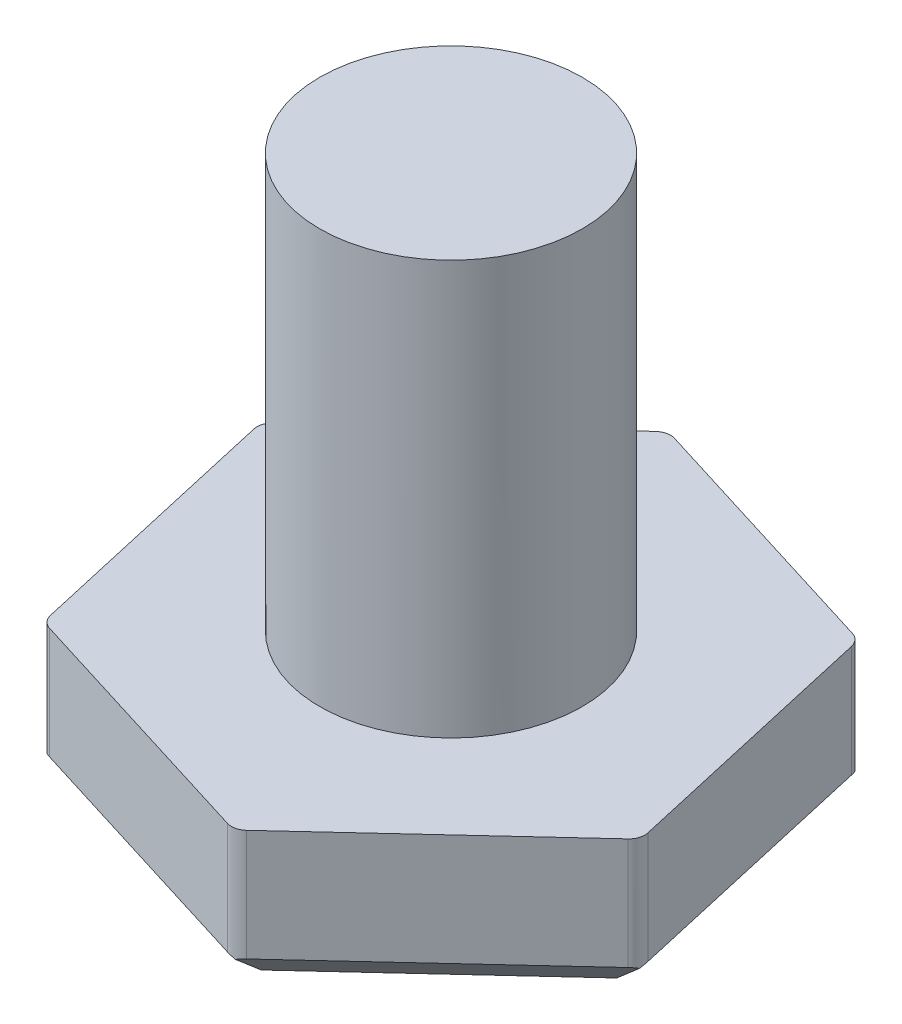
ISO-10303-21;
HEADER;
FILE_DESCRIPTION(('STEP AP214'),'2;1');
FILE_NAME('part.step','',(''),(''),'','','');
FILE_SCHEMA(('AUTOMOTIVE_DESIGN { 1 0 10303 214 1 1 1 1 }'));
ENDSEC;
DATA;
#1=APPLICATION_CONTEXT('core data for automotive mechanical design processes');
#2=APPLICATION_PROTOCOL_DEFINITION('international standard','automotive_design',2000,#1);
#3=PRODUCT_CONTEXT('',#1,'mechanical');
#4=PRODUCT('Part','Part','',(#3));
#5=PRODUCT_RELATED_PRODUCT_CATEGORY('part','',(#4));
#6=PRODUCT_DEFINITION_FORMATION('','',#4);
#7=PRODUCT_DEFINITION_CONTEXT('part definition',#1,'design');
#8=PRODUCT_DEFINITION('design','',#6,#7);
#9=PRODUCT_DEFINITION_SHAPE('','',#8);
#10=(LENGTH_UNIT() NAMED_UNIT(*) SI_UNIT(.MILLI.,.METRE.));
#11=(NAMED_UNIT(*) PLANE_ANGLE_UNIT() SI_UNIT($,.RADIAN.));
#12=(NAMED_UNIT(*) SI_UNIT($,.STERADIAN.) SOLID_ANGLE_UNIT());
#13=UNCERTAINTY_MEASURE_WITH_UNIT(LENGTH_MEASURE(1.E-05),#10,'distance_accuracy_value','');
#14=(GEOMETRIC_REPRESENTATION_CONTEXT(3) GLOBAL_UNCERTAINTY_ASSIGNED_CONTEXT((#13)) GLOBAL_UNIT_ASSIGNED_CONTEXT((#10,
#11,#12)) REPRESENTATION_CONTEXT('',''));
#15=CARTESIAN_POINT('',(0.,0.,0.));
#16=DIRECTION('',(0.,0.,1.));
#17=DIRECTION('',(1.,0.,0.));
#18=AXIS2_PLACEMENT_3D('',#15,#16,#17);
#19=CARTESIAN_POINT('',(0.,6.604,0.));
#20=DIRECTION('',(0.,-1.,0.));
#21=DIRECTION('',(0.,0.,-1.));
#22=AXIS2_PLACEMENT_3D('',#19,#20,#21);
#23=CYLINDRICAL_SURFACE('',#22,2.09536766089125);
#24=CARTESIAN_POINT('',(0.,6.604,0.));
#25=DIRECTION('',(0.,1.,0.));
#26=DIRECTION('',(0.,0.,1.));
#27=AXIS2_PLACEMENT_3D('',#24,#25,#26);
#28=CIRCLE('',#27,2.09536766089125);
#29=CARTESIAN_POINT('',(0.,6.604,2.09536766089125));
#30=VERTEX_POINT('',#29);
#31=EDGE_CURVE('E180',#30,#30,#28,.T.);
#32=ORIENTED_EDGE('',*,*,#31,.F.);
#33=EDGE_LOOP('',(#32));
#34=FACE_BOUND('',#33,.T.);
#35=CARTESIAN_POINT('',(0.,0.,0.));
#36=DIRECTION('',(0.,-1.,0.));
#37=DIRECTION('',(0.,0.,-1.));
#38=AXIS2_PLACEMENT_3D('',#35,#36,#37);
#39=CIRCLE('',#38,2.09536766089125);
#40=CARTESIAN_POINT('',(0.,0.,-2.09536766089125));
#41=VERTEX_POINT('',#40);
#42=EDGE_CURVE('E183',#41,#41,#39,.T.);
#43=ORIENTED_EDGE('',*,*,#42,.F.);
#44=EDGE_LOOP('',(#43));
#45=FACE_BOUND('',#44,.T.);
#46=ADVANCED_FACE('F30',(#34,#45),#23,.T.);
#47=CARTESIAN_POINT('',(0.,6.604,0.));
#48=DIRECTION('',(0.,1.,0.));
#49=DIRECTION('',(0.,0.,1.));
#50=AXIS2_PLACEMENT_3D('',#47,#48,#49);
#51=PLANE('',#50);
#52=ORIENTED_EDGE('',*,*,#31,.T.);
#53=EDGE_LOOP('',(#52));
#54=FACE_BOUND('',#53,.T.);
#55=ADVANCED_FACE('F309',(#54),#51,.T.);
#56=CARTESIAN_POINT('',(3.37823049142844,0.,-3.12501760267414));
#57=DIRECTION('',(0.,-1.,0.));
#58=DIRECTION('',(0.,0.,-1.));
#59=AXIS2_PLACEMENT_3D('',#56,#57,#58);
#60=PLANE('',#59);
#61=DIRECTION('',(-0.221041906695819,0.,-0.975264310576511));
#62=VECTOR('',#61,1.);
#63=CARTESIAN_POINT('',(-3.37823049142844,0.,3.12501760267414));
#64=LINE('',#63,#62);
#65=CARTESIAN_POINT('',(-3.41064561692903,0.,2.98199804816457));
#66=VERTEX_POINT('',#65);
#67=CARTESIAN_POINT('',(-4.36304475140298,0.,-1.22010506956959));
#68=VERTEX_POINT('',#67);
#69=EDGE_CURVE('E296',#66,#68,#64,.T.);
#70=ORIENTED_EDGE('',*,*,#69,.F.);
#71=CARTESIAN_POINT('',(-3.1629284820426,0.,2.92585340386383));
#72=DIRECTION('',(0.,-1.,0.));
#73=DIRECTION('',(0.,0.,-1.));
#74=AXIS2_PLACEMENT_3D('',#71,#72,#73);
#75=CIRCLE('',#74,0.254);
#76=CARTESIAN_POINT('',(-3.23816436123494,0.,3.16845505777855));
#77=VERTEX_POINT('',#76);
#78=EDGE_CURVE('E235',#66,#77,#75,.F.);
#79=ORIENTED_EDGE('',*,*,#78,.T.);
#80=DIRECTION('',(-0.955124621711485,0.,-0.296204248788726));
#81=VECTOR('',#80,1.);
#82=CARTESIAN_POINT('',(1.01722938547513,0.,4.48814222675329));
#83=LINE('',#82,#81);
#84=CARTESIAN_POINT('',(0.877163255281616,0.,4.44470477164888));
#85=VERTEX_POINT('',#84);
#86=EDGE_CURVE('E292',#85,#77,#83,.T.);
#87=ORIENTED_EDGE('',*,*,#86,.F.);
#88=CARTESIAN_POINT('',(0.952399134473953,0.,4.20210311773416));
#89=DIRECTION('',(0.,-1.,0.));
#90=DIRECTION('',(0.,0.,-1.));
#91=AXIS2_PLACEMENT_3D('',#88,#89,#90);
#92=CIRCLE('',#91,0.254);
#93=CARTESIAN_POINT('',(1.12488039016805,0.,4.38856012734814));
#94=VERTEX_POINT('',#93);
#95=EDGE_CURVE('E225',#85,#94,#92,.F.);
#96=ORIENTED_EDGE('',*,*,#95,.T.);
#97=DIRECTION('',(-0.734082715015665,0.,0.679060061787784));
#98=VECTOR('',#97,1.);
#99=CARTESIAN_POINT('',(4.39545987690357,0.,1.36312462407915));
#100=LINE('',#99,#98);
#101=CARTESIAN_POINT('',(4.28780887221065,0.,1.46270672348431));
#102=VERTEX_POINT('',#101);
#103=EDGE_CURVE('E283',#102,#94,#100,.T.);
#104=ORIENTED_EDGE('',*,*,#103,.F.);
#105=CARTESIAN_POINT('',(4.11532761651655,0.,1.27624971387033));
#106=DIRECTION('',(0.,-1.,0.));
#107=DIRECTION('',(0.,0.,-1.));
#108=AXIS2_PLACEMENT_3D('',#105,#106,#107);
#109=CIRCLE('',#108,0.254);
#110=CARTESIAN_POINT('',(4.36304475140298,0.,1.22010506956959));
#111=VERTEX_POINT('',#110);
#112=EDGE_CURVE('E227',#102,#111,#109,.F.);
#113=ORIENTED_EDGE('',*,*,#112,.T.);
#114=DIRECTION('',(0.221041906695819,0.,0.975264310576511));
#115=VECTOR('',#114,1.);
#116=CARTESIAN_POINT('',(3.37823049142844,0.,-3.12501760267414));
#117=LINE('',#116,#115);
#118=CARTESIAN_POINT('',(3.41064561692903,0.,-2.98199804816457));
#119=VERTEX_POINT('',#118);
#120=EDGE_CURVE('E293',#119,#111,#117,.T.);
#121=ORIENTED_EDGE('',*,*,#120,.F.);
#122=CARTESIAN_POINT('',(3.1629284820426,0.,-2.92585340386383));
#123=DIRECTION('',(0.,-1.,0.));
#124=DIRECTION('',(0.,0.,-1.));
#125=AXIS2_PLACEMENT_3D('',#122,#123,#124);
#126=CIRCLE('',#125,0.254);
#127=CARTESIAN_POINT('',(3.23816436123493,0.,-3.16845505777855));
#128=VERTEX_POINT('',#127);
#129=EDGE_CURVE('E229',#119,#128,#126,.F.);
#130=ORIENTED_EDGE('',*,*,#129,.T.);
#131=DIRECTION('',(0.955124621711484,0.,0.296204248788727));
#132=VECTOR('',#131,1.);
#133=CARTESIAN_POINT('',(-1.01722938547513,0.,-4.48814222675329));
#134=LINE('',#133,#132);
#135=CARTESIAN_POINT('',(-0.877163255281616,0.,-4.44470477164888));
#136=VERTEX_POINT('',#135);
#137=EDGE_CURVE('E220',#136,#128,#134,.T.);
#138=ORIENTED_EDGE('',*,*,#137,.F.);
#139=CARTESIAN_POINT('',(-0.952399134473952,0.,-4.20210311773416));
#140=DIRECTION('',(0.,-1.,0.));
#141=DIRECTION('',(0.,0.,-1.));
#142=AXIS2_PLACEMENT_3D('',#139,#140,#141);
#143=CIRCLE('',#142,0.254);
#144=CARTESIAN_POINT('',(-1.12488039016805,0.,-4.38856012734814));
#145=VERTEX_POINT('',#144);
#146=EDGE_CURVE('E231',#136,#145,#143,.F.);
#147=ORIENTED_EDGE('',*,*,#146,.T.);
#148=DIRECTION('',(0.734082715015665,0.,-0.679060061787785));
#149=VECTOR('',#148,1.);
#150=CARTESIAN_POINT('',(-4.39545987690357,0.,-1.36312462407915));
#151=LINE('',#150,#149);
#152=CARTESIAN_POINT('',(-4.28780887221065,0.,-1.4627067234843));
#153=VERTEX_POINT('',#152);
#154=EDGE_CURVE('E303',#153,#145,#151,.T.);
#155=ORIENTED_EDGE('',*,*,#154,.F.);
#156=CARTESIAN_POINT('',(-4.11532761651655,0.,-1.27624971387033));
#157=DIRECTION('',(0.,-1.,0.));
#158=DIRECTION('',(0.,0.,-1.));
#159=AXIS2_PLACEMENT_3D('',#156,#157,#158);
#160=CIRCLE('',#159,0.254);
#161=EDGE_CURVE('E233',#153,#68,#160,.F.);
#162=ORIENTED_EDGE('',*,*,#161,.T.);
#163=EDGE_LOOP('',(#70,#79,#87,#96,#104,#113,#121,#130,#138,#147,#155,#162));
#164=FACE_BOUND('',#163,.T.);
#165=ORIENTED_EDGE('',*,*,#42,.T.);
#166=EDGE_LOOP('',(#165));
#167=FACE_BOUND('',#166,.T.);
#168=ADVANCED_FACE('F287',(#164,#167),#60,.F.);
#169=CARTESIAN_POINT('',(-1.01722938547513,-2.286,-4.48814222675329));
#170=DIRECTION('',(-0.296204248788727,0.,0.955124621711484));
#171=DIRECTION('',(0.955124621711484,0.,0.296204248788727));
#172=AXIS2_PLACEMENT_3D('',#169,#170,#171);
#173=PLANE('',#172);
#174=DIRECTION('',(-0.955124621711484,0.,-0.296204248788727));
#175=VECTOR('',#174,1.);
#176=CARTESIAN_POINT('',(-1.01722938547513,-1.778,-4.48814222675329));
#177=LINE('',#176,#175);
#178=CARTESIAN_POINT('',(3.23816436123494,-1.778,-3.16845505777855));
#179=VERTEX_POINT('',#178);
#180=CARTESIAN_POINT('',(-0.877163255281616,-1.778,-4.44470477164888));
#181=VERTEX_POINT('',#180);
#182=EDGE_CURVE('E201',#179,#181,#177,.T.);
#183=ORIENTED_EDGE('',*,*,#182,.T.);
#184=DIRECTION('',(0.,1.,0.));
#185=VECTOR('',#184,1.);
#186=CARTESIAN_POINT('',(-0.877163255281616,-2.286,-4.44470477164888));
#187=LINE('',#186,#185);
#188=EDGE_CURVE('E261',#181,#136,#187,.T.);
#189=ORIENTED_EDGE('',*,*,#188,.T.);
#190=ORIENTED_EDGE('',*,*,#137,.T.);
#191=DIRECTION('',(0.,1.,0.));
#192=VECTOR('',#191,1.);
#193=CARTESIAN_POINT('',(3.23816436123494,-2.286,-3.16845505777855));
#194=LINE('',#193,#192);
#195=EDGE_CURVE('E259',#128,#179,#194,.F.);
#196=ORIENTED_EDGE('',*,*,#195,.T.);
#197=EDGE_LOOP('',(#183,#189,#190,#196));
#198=FACE_BOUND('',#197,.T.);
#199=ADVANCED_FACE('F374',(#198),#173,.F.);
#200=CARTESIAN_POINT('',(3.37823049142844,-2.286,-3.12501760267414));
#201=DIRECTION('',(-0.975264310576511,0.,0.221041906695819));
#202=DIRECTION('',(0.221041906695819,0.,0.975264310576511));
#203=AXIS2_PLACEMENT_3D('',#200,#201,#202);
#204=PLANE('',#203);
#205=DIRECTION('',(-0.221041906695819,0.,-0.975264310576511));
#206=VECTOR('',#205,1.);
#207=CARTESIAN_POINT('',(3.37823049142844,-1.778,-3.12501760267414));
#208=LINE('',#207,#206);
#209=CARTESIAN_POINT('',(4.36304475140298,-1.778,1.22010506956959));
#210=VERTEX_POINT('',#209);
#211=CARTESIAN_POINT('',(3.41064561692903,-1.778,-2.98199804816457));
#212=VERTEX_POINT('',#211);
#213=EDGE_CURVE('E204',#210,#212,#208,.T.);
#214=ORIENTED_EDGE('',*,*,#213,.T.);
#215=DIRECTION('',(0.,1.,0.));
#216=VECTOR('',#215,1.);
#217=CARTESIAN_POINT('',(3.41064561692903,-2.286,-2.98199804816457));
#218=LINE('',#217,#216);
#219=EDGE_CURVE('E270',#212,#119,#218,.T.);
#220=ORIENTED_EDGE('',*,*,#219,.T.);
#221=ORIENTED_EDGE('',*,*,#120,.T.);
#222=DIRECTION('',(0.,1.,0.));
#223=VECTOR('',#222,1.);
#224=CARTESIAN_POINT('',(4.36304475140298,-2.286,1.22010506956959));
#225=LINE('',#224,#223);
#226=EDGE_CURVE('E268',#111,#210,#225,.F.);
#227=ORIENTED_EDGE('',*,*,#226,.T.);
#228=EDGE_LOOP('',(#214,#220,#221,#227));
#229=FACE_BOUND('',#228,.T.);
#230=ADVANCED_FACE('F368',(#229),#204,.F.);
#231=CARTESIAN_POINT('',(4.39545987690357,-2.286,1.36312462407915));
#232=DIRECTION('',(-0.679060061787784,0.,-0.734082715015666));
#233=DIRECTION('',(-0.734082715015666,0.,0.679060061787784));
#234=AXIS2_PLACEMENT_3D('',#231,#232,#233);
#235=PLANE('',#234);
#236=DIRECTION('',(0.734082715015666,0.,-0.679060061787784));
#237=VECTOR('',#236,1.);
#238=CARTESIAN_POINT('',(4.39545987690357,-1.778,1.36312462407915));
#239=LINE('',#238,#237);
#240=CARTESIAN_POINT('',(1.12488039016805,-1.778,4.38856012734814));
#241=VERTEX_POINT('',#240);
#242=CARTESIAN_POINT('',(4.28780887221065,-1.778,1.46270672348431));
#243=VERTEX_POINT('',#242);
#244=EDGE_CURVE('E207',#241,#243,#239,.T.);
#245=ORIENTED_EDGE('',*,*,#244,.T.);
#246=DIRECTION('',(0.,1.,0.));
#247=VECTOR('',#246,1.);
#248=CARTESIAN_POINT('',(4.28780887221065,-2.286,1.46270672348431));
#249=LINE('',#248,#247);
#250=EDGE_CURVE('E278',#243,#102,#249,.T.);
#251=ORIENTED_EDGE('',*,*,#250,.T.);
#252=ORIENTED_EDGE('',*,*,#103,.T.);
#253=DIRECTION('',(0.,1.,0.));
#254=VECTOR('',#253,1.);
#255=CARTESIAN_POINT('',(1.12488039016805,-2.286,4.38856012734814));
#256=LINE('',#255,#254);
#257=EDGE_CURVE('E50',#94,#241,#256,.F.);
#258=ORIENTED_EDGE('',*,*,#257,.T.);
#259=EDGE_LOOP('',(#245,#251,#252,#258));
#260=FACE_BOUND('',#259,.T.);
#261=ADVANCED_FACE('F282',(#260),#235,.F.);
#262=CARTESIAN_POINT('',(1.01722938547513,-2.286,4.48814222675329));
#263=DIRECTION('',(0.296204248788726,0.,-0.955124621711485));
#264=DIRECTION('',(-0.955124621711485,0.,-0.296204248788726));
#265=AXIS2_PLACEMENT_3D('',#262,#263,#264);
#266=PLANE('',#265);
#267=ORIENTED_EDGE('',*,*,#86,.T.);
#268=DIRECTION('',(0.,1.,0.));
#269=VECTOR('',#268,1.);
#270=CARTESIAN_POINT('',(-3.23816436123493,-2.286,3.16845505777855));
#271=LINE('',#270,#269);
#272=CARTESIAN_POINT('',(-3.23816436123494,-1.778,3.16845505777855));
#273=VERTEX_POINT('',#272);
#274=EDGE_CURVE('E240',#77,#273,#271,.F.);
#275=ORIENTED_EDGE('',*,*,#274,.T.);
#276=DIRECTION('',(0.955124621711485,0.,0.296204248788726));
#277=VECTOR('',#276,1.);
#278=CARTESIAN_POINT('',(1.01722938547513,-1.778,4.48814222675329));
#279=LINE('',#278,#277);
#280=CARTESIAN_POINT('',(0.877163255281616,-1.778,4.44470477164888));
#281=VERTEX_POINT('',#280);
#282=EDGE_CURVE('E209',#273,#281,#279,.T.);
#283=ORIENTED_EDGE('',*,*,#282,.T.);
#284=DIRECTION('',(0.,1.,0.));
#285=VECTOR('',#284,1.);
#286=CARTESIAN_POINT('',(0.877163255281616,-2.286,4.44470477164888));
#287=LINE('',#286,#285);
#288=EDGE_CURVE('E237',#281,#85,#287,.T.);
#289=ORIENTED_EDGE('',*,*,#288,.T.);
#290=EDGE_LOOP('',(#267,#275,#283,#289));
#291=FACE_BOUND('',#290,.T.);
#292=ADVANCED_FACE('F396',(#291),#266,.F.);
#293=CARTESIAN_POINT('',(-3.37823049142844,-2.286,3.12501760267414));
#294=DIRECTION('',(0.975264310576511,0.,-0.221041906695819));
#295=DIRECTION('',(-0.221041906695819,0.,-0.975264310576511));
#296=AXIS2_PLACEMENT_3D('',#293,#294,#295);
#297=PLANE('',#296);
#298=DIRECTION('',(0.221041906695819,0.,0.975264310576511));
#299=VECTOR('',#298,1.);
#300=CARTESIAN_POINT('',(-3.37823049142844,-1.778,3.12501760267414));
#301=LINE('',#300,#299);
#302=CARTESIAN_POINT('',(-4.36304475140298,-1.778,-1.22010506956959));
#303=VERTEX_POINT('',#302);
#304=CARTESIAN_POINT('',(-3.41064561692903,-1.778,2.98199804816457));
#305=VERTEX_POINT('',#304);
#306=EDGE_CURVE('E195',#303,#305,#301,.T.);
#307=ORIENTED_EDGE('',*,*,#306,.T.);
#308=DIRECTION('',(0.,1.,0.));
#309=VECTOR('',#308,1.);
#310=CARTESIAN_POINT('',(-3.41064561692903,-2.286,2.98199804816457));
#311=LINE('',#310,#309);
#312=EDGE_CURVE('E222',#305,#66,#311,.T.);
#313=ORIENTED_EDGE('',*,*,#312,.T.);
#314=ORIENTED_EDGE('',*,*,#69,.T.);
#315=DIRECTION('',(0.,1.,0.));
#316=VECTOR('',#315,1.);
#317=CARTESIAN_POINT('',(-4.36304475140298,-2.286,-1.22010506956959));
#318=LINE('',#317,#316);
#319=EDGE_CURVE('E212',#68,#303,#318,.F.);
#320=ORIENTED_EDGE('',*,*,#319,.T.);
#321=EDGE_LOOP('',(#307,#313,#314,#320));
#322=FACE_BOUND('',#321,.T.);
#323=ADVANCED_FACE('F389',(#322),#297,.F.);
#324=CARTESIAN_POINT('',(-4.39545987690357,-2.286,-1.36312462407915));
#325=DIRECTION('',(0.679060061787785,0.,0.734082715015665));
#326=DIRECTION('',(0.734082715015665,0.,-0.679060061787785));
#327=AXIS2_PLACEMENT_3D('',#324,#325,#326);
#328=PLANE('',#327);
#329=DIRECTION('',(-0.734082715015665,0.,0.679060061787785));
#330=VECTOR('',#329,1.);
#331=CARTESIAN_POINT('',(-4.39545987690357,-1.778,-1.36312462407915));
#332=LINE('',#331,#330);
#333=CARTESIAN_POINT('',(-1.12488039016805,-1.778,-4.38856012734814));
#334=VERTEX_POINT('',#333);
#335=CARTESIAN_POINT('',(-4.28780887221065,-1.778,-1.4627067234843));
#336=VERTEX_POINT('',#335);
#337=EDGE_CURVE('E198',#334,#336,#332,.T.);
#338=ORIENTED_EDGE('',*,*,#337,.T.);
#339=DIRECTION('',(0.,1.,0.));
#340=VECTOR('',#339,1.);
#341=CARTESIAN_POINT('',(-4.28780887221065,-2.286,-1.4627067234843));
#342=LINE('',#341,#340);
#343=EDGE_CURVE('E252',#336,#153,#342,.T.);
#344=ORIENTED_EDGE('',*,*,#343,.T.);
#345=ORIENTED_EDGE('',*,*,#154,.T.);
#346=DIRECTION('',(0.,1.,0.));
#347=VECTOR('',#346,1.);
#348=CARTESIAN_POINT('',(-1.12488039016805,-2.286,-4.38856012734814));
#349=LINE('',#348,#347);
#350=EDGE_CURVE('E250',#145,#334,#349,.F.);
#351=ORIENTED_EDGE('',*,*,#350,.T.);
#352=EDGE_LOOP('',(#338,#344,#345,#351));
#353=FACE_BOUND('',#352,.T.);
#354=ADVANCED_FACE('F382',(#353),#328,.F.);
#355=CARTESIAN_POINT('',(3.37823049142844,-2.286,-3.12501760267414));
#356=DIRECTION('',(0.,-1.,0.));
#357=DIRECTION('',(0.,0.,-1.));
#358=AXIS2_PLACEMENT_3D('',#355,#356,#357);
#359=PLANE('',#358);
#360=DIRECTION('',(-0.955124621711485,0.,-0.296204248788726));
#361=VECTOR('',#360,1.);
#362=CARTESIAN_POINT('',(-3.22775873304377,-2.286,2.6398142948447));
#363=LINE('',#362,#361);
#364=CARTESIAN_POINT('',(0.887568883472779,-2.286,3.91606400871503));
#365=VERTEX_POINT('',#364);
#366=CARTESIAN_POINT('',(-2.94762647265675,-2.286,2.72668920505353));
#367=VERTEX_POINT('',#366);
#368=EDGE_CURVE('E159',#365,#367,#363,.T.);
#369=ORIENTED_EDGE('',*,*,#368,.T.);
#370=DIRECTION('',(-0.221041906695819,0.,-0.975264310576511));
#371=VECTOR('',#370,1.);
#372=CARTESIAN_POINT('',(-3.9000256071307,-2.286,-1.47541391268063));
#373=LINE('',#372,#371);
#374=CARTESIAN_POINT('',(-3.83519535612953,-2.286,-1.1893748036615));
#375=VERTEX_POINT('',#374);
#376=EDGE_CURVE('E193',#367,#375,#373,.T.);
#377=ORIENTED_EDGE('',*,*,#376,.T.);
#378=DIRECTION('',(0.734082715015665,0.,-0.679060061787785));
#379=VECTOR('',#378,1.);
#380=CARTESIAN_POINT('',(-0.672266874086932,-2.286,-4.11522820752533));
#381=LINE('',#380,#379);
#382=CARTESIAN_POINT('',(-0.887568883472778,-2.286,-3.91606400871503));
#383=VERTEX_POINT('',#382);
#384=EDGE_CURVE('E190',#375,#383,#381,.T.);
#385=ORIENTED_EDGE('',*,*,#384,.T.);
#386=DIRECTION('',(0.955124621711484,0.,0.296204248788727));
#387=VECTOR('',#386,1.);
#388=CARTESIAN_POINT('',(3.22775873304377,-2.286,-2.6398142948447));
#389=LINE('',#388,#387);
#390=CARTESIAN_POINT('',(2.94762647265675,-2.286,-2.72668920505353));
#391=VERTEX_POINT('',#390);
#392=EDGE_CURVE('E188',#383,#391,#389,.T.);
#393=ORIENTED_EDGE('',*,*,#392,.T.);
#394=DIRECTION('',(0.221041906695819,0.,0.975264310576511));
#395=VECTOR('',#394,1.);
#396=CARTESIAN_POINT('',(3.9000256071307,-2.286,1.47541391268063));
#397=LINE('',#396,#395);
#398=CARTESIAN_POINT('',(3.83519535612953,-2.286,1.1893748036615));
#399=VERTEX_POINT('',#398);
#400=EDGE_CURVE('E163',#391,#399,#397,.T.);
#401=ORIENTED_EDGE('',*,*,#400,.T.);
#402=DIRECTION('',(-0.734082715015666,0.,0.679060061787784));
#403=VECTOR('',#402,1.);
#404=CARTESIAN_POINT('',(0.672266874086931,-2.286,4.11522820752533));
#405=LINE('',#404,#403);
#406=EDGE_CURVE('E154',#399,#365,#405,.T.);
#407=ORIENTED_EDGE('',*,*,#406,.T.);
#408=EDGE_LOOP('',(#369,#377,#385,#393,#401,#407));
#409=FACE_BOUND('',#408,.T.);
#410=ADVANCED_FACE('F156',(#409),#359,.T.);
#411=CARTESIAN_POINT('',(2.88279622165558,-2.286,-3.01272831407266));
#412=DIRECTION('',(0.689616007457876,-0.707106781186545,-0.156300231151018));
#413=DIRECTION('',(0.715905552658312,0.69819713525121,0.));
#414=AXIS2_PLACEMENT_3D('',#411,#412,#413);
#415=PLANE('',#414);
#416=DIRECTION('',(0.554914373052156,0.65465367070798,-0.513321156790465));
#417=VECTOR('',#416,1.);
#418=CARTESIAN_POINT('',(3.00914133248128,-2.21342857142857,-2.78359326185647));
#419=LINE('',#418,#417);
#420=CARTESIAN_POINT('',(3.34938549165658,-1.81202954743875,-3.09833465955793));
#421=VERTEX_POINT('',#420);
#422=EDGE_CURVE('E172',#421,#391,#419,.F.);
#423=ORIENTED_EDGE('',*,*,#422,.F.);
#424=CARTESIAN_POINT('',(3.1629284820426,-2.032,-2.92585340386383));
#425=DIRECTION('',(0.689616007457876,-0.707106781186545,-0.156300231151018));
#426=DIRECTION('',(0.689616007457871,0.70710678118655,-0.156300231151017));
#427=AXIS2_PLACEMENT_3D('',#424,#425,#426);
#428=ELLIPSE('',#427,0.359210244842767,0.254);
#429=EDGE_CURVE('E275',#421,#212,#428,.T.);
#430=ORIENTED_EDGE('',*,*,#429,.T.);
#431=ORIENTED_EDGE('',*,*,#213,.F.);
#432=CARTESIAN_POINT('',(4.11532761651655,-2.032,1.27624971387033));
#433=DIRECTION('',(0.689616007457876,-0.707106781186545,-0.156300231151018));
#434=DIRECTION('',(0.689616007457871,0.70710678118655,-0.156300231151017));
#435=AXIS2_PLACEMENT_3D('',#432,#433,#434);
#436=ELLIPSE('',#435,0.359210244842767,0.254);
#437=CARTESIAN_POINT('',(4.35792927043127,-1.81202954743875,1.35148559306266));
#438=VERTEX_POINT('',#437);
#439=EDGE_CURVE('E273',#210,#438,#436,.T.);
#440=ORIENTED_EDGE('',*,*,#439,.T.);
#441=DIRECTION('',(0.722006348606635,0.65465367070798,0.22390936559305));
#442=VECTOR('',#441,1.);
#443=CARTESIAN_POINT('',(4.54315598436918,-1.64408178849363,1.40892829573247));
#444=LINE('',#443,#442);
#445=EDGE_CURVE('E218',#399,#438,#444,.T.);
#446=ORIENTED_EDGE('',*,*,#445,.F.);
#447=ORIENTED_EDGE('',*,*,#400,.F.);
#448=EDGE_LOOP('',(#423,#430,#431,#440,#446,#447));
#449=FACE_BOUND('',#448,.T.);
#450=ADVANCED_FACE('F337',(#449),#415,.T.);
#451=CARTESIAN_POINT('',(5.7396126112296,-2.286,-0.572298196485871));
#452=DIRECTION('',(0.4801679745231,-0.707106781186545,0.519074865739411));
#453=DIRECTION('',(0.,-0.591756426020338,-0.806116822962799));
#454=AXIS2_PLACEMENT_3D('',#451,#452,#453);
#455=PLANE('',#454);
#456=ORIENTED_EDGE('',*,*,#445,.T.);
#457=CARTESIAN_POINT('',(4.11532761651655,-2.032,1.27624971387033));
#458=DIRECTION('',(0.4801679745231,-0.707106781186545,0.519074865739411));
#459=DIRECTION('',(0.480167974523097,0.70710678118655,0.519074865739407));
#460=AXIS2_PLACEMENT_3D('',#457,#458,#459);
#461=ELLIPSE('',#460,0.359210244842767,0.254);
#462=EDGE_CURVE('E11',#438,#243,#461,.T.);
#463=ORIENTED_EDGE('',*,*,#462,.T.);
#464=ORIENTED_EDGE('',*,*,#244,.F.);
#465=CARTESIAN_POINT('',(0.952399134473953,-2.032,4.20210311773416));
#466=DIRECTION('',(0.4801679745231,-0.707106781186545,0.519074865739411));
#467=DIRECTION('',(0.480167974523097,0.70710678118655,0.519074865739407));
#468=AXIS2_PLACEMENT_3D('',#465,#466,#467);
#469=ELLIPSE('',#468,0.359210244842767,0.254);
#470=CARTESIAN_POINT('',(1.00854377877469,-1.81202954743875,4.44982025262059));
#471=VERTEX_POINT('',#470);
#472=EDGE_CURVE('E38',#241,#471,#469,.T.);
#473=ORIENTED_EDGE('',*,*,#472,.T.);
#474=DIRECTION('',(0.167091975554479,0.654653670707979,0.737230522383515));
#475=VECTOR('',#474,1.);
#476=CARTESIAN_POINT('',(0.906091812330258,-2.21342857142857,3.99778946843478));
#477=LINE('',#476,#475);
#478=EDGE_CURVE('E167',#365,#471,#477,.T.);
#479=ORIENTED_EDGE('',*,*,#478,.F.);
#480=ORIENTED_EDGE('',*,*,#406,.F.);
#481=EDGE_LOOP('',(#456,#463,#464,#473,#479,#480));
#482=FACE_BOUND('',#481,.T.);
#483=ADVANCED_FACE('F168',(#482),#455,.T.);
#484=CARTESIAN_POINT('',(3.22775873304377,-2.286,-2.6398142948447));
#485=DIRECTION('',(0.209448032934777,-0.707106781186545,-0.675375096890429));
#486=DIRECTION('',(0.,0.690694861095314,-0.723146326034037));
#487=AXIS2_PLACEMENT_3D('',#484,#485,#486);
#488=PLANE('',#487);
#489=DIRECTION('',(-0.16709197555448,0.654653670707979,-0.737230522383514));
#490=VECTOR('',#489,1.);
#491=CARTESIAN_POINT('',(-0.615454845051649,-3.35212213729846,-2.71546311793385));
#492=LINE('',#491,#490);
#493=CARTESIAN_POINT('',(-1.00854377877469,-1.81202954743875,-4.44982025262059));
#494=VERTEX_POINT('',#493);
#495=EDGE_CURVE('E173',#494,#383,#492,.F.);
#496=ORIENTED_EDGE('',*,*,#495,.F.);
#497=CARTESIAN_POINT('',(-0.952399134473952,-2.032,-4.20210311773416));
#498=DIRECTION('',(0.209448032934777,-0.707106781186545,-0.675375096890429));
#499=DIRECTION('',(0.209448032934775,0.70710678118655,-0.675375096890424));
#500=AXIS2_PLACEMENT_3D('',#497,#498,#499);
#501=ELLIPSE('',#500,0.359210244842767,0.254);
#502=EDGE_CURVE('E266',#494,#181,#501,.T.);
#503=ORIENTED_EDGE('',*,*,#502,.T.);
#504=ORIENTED_EDGE('',*,*,#182,.F.);
#505=CARTESIAN_POINT('',(3.1629284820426,-2.032,-2.92585340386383));
#506=DIRECTION('',(0.209448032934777,-0.707106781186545,-0.675375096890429));
#507=DIRECTION('',(0.209448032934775,0.70710678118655,-0.675375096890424));
#508=AXIS2_PLACEMENT_3D('',#505,#506,#507);
#509=ELLIPSE('',#508,0.359210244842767,0.254);
#510=EDGE_CURVE('E264',#179,#421,#509,.T.);
#511=ORIENTED_EDGE('',*,*,#510,.T.);
#512=ORIENTED_EDGE('',*,*,#422,.T.);
#513=ORIENTED_EDGE('',*,*,#392,.F.);
#514=EDGE_LOOP('',(#496,#503,#504,#511,#512,#513));
#515=FACE_BOUND('',#514,.T.);
#516=ADVANCED_FACE('F331',(#515),#488,.T.);
#517=CARTESIAN_POINT('',(1.1677011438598,-2.286,4.00293891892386));
#518=DIRECTION('',(-0.209448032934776,-0.707106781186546,0.675375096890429));
#519=DIRECTION('',(0.,-0.690694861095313,-0.723146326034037));
#520=AXIS2_PLACEMENT_3D('',#517,#518,#519);
#521=PLANE('',#520);
#522=ORIENTED_EDGE('',*,*,#282,.F.);
#523=CARTESIAN_POINT('',(-3.1629284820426,-2.032,2.92585340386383));
#524=DIRECTION('',(-0.209448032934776,-0.707106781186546,0.675375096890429));
#525=DIRECTION('',(-0.209448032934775,0.70710678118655,0.675375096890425));
#526=AXIS2_PLACEMENT_3D('',#523,#524,#525);
#527=ELLIPSE('',#526,0.359210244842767,0.254);
#528=CARTESIAN_POINT('',(-3.34938549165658,-1.81202954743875,3.09833465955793));
#529=VERTEX_POINT('',#528);
#530=EDGE_CURVE('E244',#273,#529,#527,.T.);
#531=ORIENTED_EDGE('',*,*,#530,.T.);
#532=DIRECTION('',(0.554914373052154,-0.65465367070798,-0.513321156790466));
#533=VECTOR('',#532,1.);
#534=CARTESIAN_POINT('',(-2.04393262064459,-3.35212213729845,1.89073108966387));
#535=LINE('',#534,#533);
#536=EDGE_CURVE('E178',#367,#529,#535,.F.);
#537=ORIENTED_EDGE('',*,*,#536,.F.);
#538=ORIENTED_EDGE('',*,*,#368,.F.);
#539=ORIENTED_EDGE('',*,*,#478,.T.);
#540=CARTESIAN_POINT('',(0.952399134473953,-2.032,4.20210311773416));
#541=DIRECTION('',(-0.209448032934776,-0.707106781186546,0.675375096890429));
#542=DIRECTION('',(-0.209448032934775,0.70710678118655,0.675375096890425));
#543=AXIS2_PLACEMENT_3D('',#540,#541,#542);
#544=ELLIPSE('',#543,0.359210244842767,0.254);
#545=EDGE_CURVE('E242',#471,#281,#544,.T.);
#546=ORIENTED_EDGE('',*,*,#545,.T.);
#547=EDGE_LOOP('',(#522,#531,#537,#538,#539,#546));
#548=FACE_BOUND('',#547,.T.);
#549=ADVANCED_FACE('F176',(#548),#521,.T.);
#550=CARTESIAN_POINT('',(1.01684837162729,-2.286,-5.6777370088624));
#551=DIRECTION('',(-0.4801679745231,-0.707106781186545,-0.51907486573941));
#552=DIRECTION('',(0.,0.591756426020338,-0.806116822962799));
#553=AXIS2_PLACEMENT_3D('',#550,#551,#552);
#554=PLANE('',#553);
#555=DIRECTION('',(-0.722006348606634,0.65465367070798,-0.223909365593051));
#556=VECTOR('',#555,1.);
#557=CARTESIAN_POINT('',(-2.0314646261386,-3.92146892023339,-0.629999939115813));
#558=LINE('',#557,#556);
#559=CARTESIAN_POINT('',(-4.35792927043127,-1.81202954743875,-1.35148559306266));
#560=VERTEX_POINT('',#559);
#561=EDGE_CURVE('E213',#560,#375,#558,.F.);
#562=ORIENTED_EDGE('',*,*,#561,.F.);
#563=CARTESIAN_POINT('',(-4.11532761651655,-2.032,-1.27624971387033));
#564=DIRECTION('',(-0.4801679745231,-0.707106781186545,-0.51907486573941));
#565=DIRECTION('',(-0.480167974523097,0.70710678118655,-0.519074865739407));
#566=AXIS2_PLACEMENT_3D('',#563,#564,#565);
#567=ELLIPSE('',#566,0.359210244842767,0.254);
#568=EDGE_CURVE('E257',#560,#336,#567,.T.);
#569=ORIENTED_EDGE('',*,*,#568,.T.);
#570=ORIENTED_EDGE('',*,*,#337,.F.);
#571=CARTESIAN_POINT('',(-0.952399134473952,-2.032,-4.20210311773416));
#572=DIRECTION('',(-0.4801679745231,-0.707106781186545,-0.51907486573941));
#573=DIRECTION('',(-0.480167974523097,0.70710678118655,-0.519074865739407));
#574=AXIS2_PLACEMENT_3D('',#571,#572,#573);
#575=ELLIPSE('',#574,0.359210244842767,0.254);
#576=EDGE_CURVE('E255',#334,#494,#575,.T.);
#577=ORIENTED_EDGE('',*,*,#576,.T.);
#578=ORIENTED_EDGE('',*,*,#495,.T.);
#579=ORIENTED_EDGE('',*,*,#384,.F.);
#580=EDGE_LOOP('',(#562,#569,#570,#577,#578,#579));
#581=FACE_BOUND('',#580,.T.);
#582=ADVANCED_FACE('F324',(#581),#554,.T.);
#583=CARTESIAN_POINT('',(-3.9000256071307,-2.286,-1.47541391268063));
#584=DIRECTION('',(-0.689616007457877,-0.707106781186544,0.156300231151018));
#585=DIRECTION('',(0.715905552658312,-0.698197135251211,0.));
#586=AXIS2_PLACEMENT_3D('',#583,#584,#585);
#587=PLANE('',#586);
#588=ORIENTED_EDGE('',*,*,#536,.T.);
#589=CARTESIAN_POINT('',(-3.1629284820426,-2.032,2.92585340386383));
#590=DIRECTION('',(-0.689616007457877,-0.707106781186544,0.156300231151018));
#591=DIRECTION('',(-0.689616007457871,0.707106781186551,0.156300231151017));
#592=AXIS2_PLACEMENT_3D('',#589,#590,#591);
#593=ELLIPSE('',#592,0.359210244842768,0.254);
#594=EDGE_CURVE('E248',#529,#305,#593,.T.);
#595=ORIENTED_EDGE('',*,*,#594,.T.);
#596=ORIENTED_EDGE('',*,*,#306,.F.);
#597=CARTESIAN_POINT('',(-4.11532761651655,-2.032,-1.27624971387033));
#598=DIRECTION('',(-0.689616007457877,-0.707106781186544,0.156300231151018));
#599=DIRECTION('',(-0.689616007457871,0.707106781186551,0.156300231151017));
#600=AXIS2_PLACEMENT_3D('',#597,#598,#599);
#601=ELLIPSE('',#600,0.359210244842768,0.254);
#602=EDGE_CURVE('E246',#303,#560,#601,.T.);
#603=ORIENTED_EDGE('',*,*,#602,.T.);
#604=ORIENTED_EDGE('',*,*,#561,.T.);
#605=ORIENTED_EDGE('',*,*,#376,.F.);
#606=EDGE_LOOP('',(#588,#595,#596,#603,#604,#605));
#607=FACE_BOUND('',#606,.T.);
#608=ADVANCED_FACE('F320',(#607),#587,.T.);
#609=CARTESIAN_POINT('',(-3.1629284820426,-2.286,2.92585340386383));
#610=DIRECTION('',(0.,1.,0.));
#611=DIRECTION('',(0.,0.,1.));
#612=AXIS2_PLACEMENT_3D('',#609,#610,#611);
#613=CYLINDRICAL_SURFACE('',#612,0.254);
#614=ORIENTED_EDGE('',*,*,#530,.F.);
#615=ORIENTED_EDGE('',*,*,#274,.F.);
#616=ORIENTED_EDGE('',*,*,#78,.F.);
#617=ORIENTED_EDGE('',*,*,#312,.F.);
#618=ORIENTED_EDGE('',*,*,#594,.F.);
#619=EDGE_LOOP('',(#614,#615,#616,#617,#618));
#620=FACE_BOUND('',#619,.T.);
#621=ADVANCED_FACE('F323',(#620),#613,.T.);
#622=CARTESIAN_POINT('',(-4.11532761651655,-2.286,-1.27624971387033));
#623=DIRECTION('',(0.,1.,0.));
#624=DIRECTION('',(0.,0.,1.));
#625=AXIS2_PLACEMENT_3D('',#622,#623,#624);
#626=CYLINDRICAL_SURFACE('',#625,0.254);
#627=ORIENTED_EDGE('',*,*,#602,.F.);
#628=ORIENTED_EDGE('',*,*,#319,.F.);
#629=ORIENTED_EDGE('',*,*,#161,.F.);
#630=ORIENTED_EDGE('',*,*,#343,.F.);
#631=ORIENTED_EDGE('',*,*,#568,.F.);
#632=EDGE_LOOP('',(#627,#628,#629,#630,#631));
#633=FACE_BOUND('',#632,.T.);
#634=ADVANCED_FACE('F343',(#633),#626,.T.);
#635=CARTESIAN_POINT('',(-0.952399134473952,-2.286,-4.20210311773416));
#636=DIRECTION('',(0.,1.,0.));
#637=DIRECTION('',(0.,0.,1.));
#638=AXIS2_PLACEMENT_3D('',#635,#636,#637);
#639=CYLINDRICAL_SURFACE('',#638,0.254);
#640=ORIENTED_EDGE('',*,*,#576,.F.);
#641=ORIENTED_EDGE('',*,*,#350,.F.);
#642=ORIENTED_EDGE('',*,*,#146,.F.);
#643=ORIENTED_EDGE('',*,*,#188,.F.);
#644=ORIENTED_EDGE('',*,*,#502,.F.);
#645=EDGE_LOOP('',(#640,#641,#642,#643,#644));
#646=FACE_BOUND('',#645,.T.);
#647=ADVANCED_FACE('F347',(#646),#639,.T.);
#648=CARTESIAN_POINT('',(3.1629284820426,-2.286,-2.92585340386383));
#649=DIRECTION('',(0.,1.,0.));
#650=DIRECTION('',(0.,0.,1.));
#651=AXIS2_PLACEMENT_3D('',#648,#649,#650);
#652=CYLINDRICAL_SURFACE('',#651,0.254);
#653=ORIENTED_EDGE('',*,*,#510,.F.);
#654=ORIENTED_EDGE('',*,*,#195,.F.);
#655=ORIENTED_EDGE('',*,*,#129,.F.);
#656=ORIENTED_EDGE('',*,*,#219,.F.);
#657=ORIENTED_EDGE('',*,*,#429,.F.);
#658=EDGE_LOOP('',(#653,#654,#655,#656,#657));
#659=FACE_BOUND('',#658,.T.);
#660=ADVANCED_FACE('F351',(#659),#652,.T.);
#661=CARTESIAN_POINT('',(4.11532761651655,-2.286,1.27624971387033));
#662=DIRECTION('',(0.,1.,0.));
#663=DIRECTION('',(0.,0.,1.));
#664=AXIS2_PLACEMENT_3D('',#661,#662,#663);
#665=CYLINDRICAL_SURFACE('',#664,0.254);
#666=ORIENTED_EDGE('',*,*,#439,.F.);
#667=ORIENTED_EDGE('',*,*,#226,.F.);
#668=ORIENTED_EDGE('',*,*,#112,.F.);
#669=ORIENTED_EDGE('',*,*,#250,.F.);
#670=ORIENTED_EDGE('',*,*,#462,.F.);
#671=EDGE_LOOP('',(#666,#667,#668,#669,#670));
#672=FACE_BOUND('',#671,.T.);
#673=ADVANCED_FACE('F354',(#672),#665,.T.);
#674=CARTESIAN_POINT('',(0.952399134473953,-2.286,4.20210311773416));
#675=DIRECTION('',(0.,1.,0.));
#676=DIRECTION('',(0.,0.,1.));
#677=AXIS2_PLACEMENT_3D('',#674,#675,#676);
#678=CYLINDRICAL_SURFACE('',#677,0.254);
#679=ORIENTED_EDGE('',*,*,#472,.F.);
#680=ORIENTED_EDGE('',*,*,#257,.F.);
#681=ORIENTED_EDGE('',*,*,#95,.F.);
#682=ORIENTED_EDGE('',*,*,#288,.F.);
#683=ORIENTED_EDGE('',*,*,#545,.F.);
#684=EDGE_LOOP('',(#679,#680,#681,#682,#683));
#685=FACE_BOUND('',#684,.T.);
#686=ADVANCED_FACE('F32',(#685),#678,.T.);
#687=CLOSED_SHELL('',(#46,#55,#168,#199,#230,#261,#292,#323,#354,#410,#450,#483,#516,#549,#582,
#608,#621,#634,#647,#660,#673,#686));
#688=MANIFOLD_SOLID_BREP('B2',#687);
#689=ADVANCED_BREP_SHAPE_REPRESENTATION('',(#18,#688),#14);
#690=SHAPE_DEFINITION_REPRESENTATION(#9,#689);
ENDSEC;
END-ISO-10303-21;
